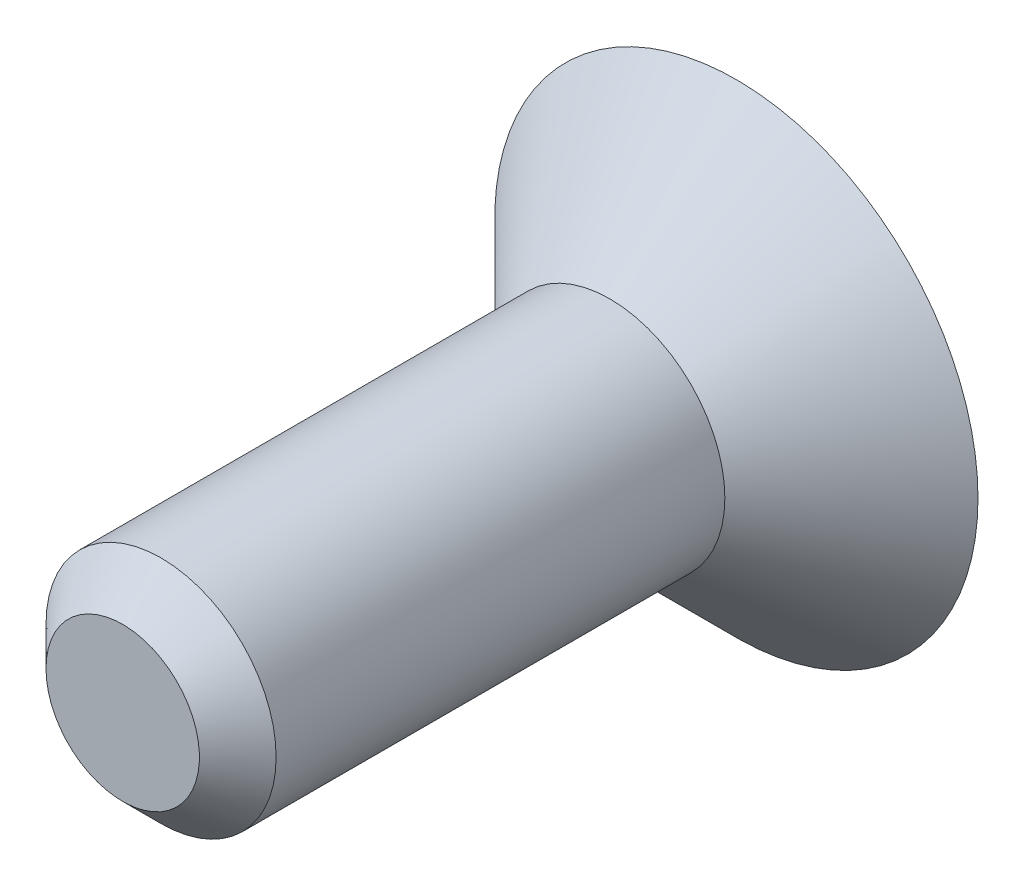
from build123d import *

# Parameters (mm, degrees)
ESQUISSE1_R                  = 3.15
T_TE_DEPTH                   = 2
T_TE_TAPER                   = 45
ESQUISSE2_R                  = 1.5
CORPS_DEPTH                  = 8
ESQUISSE3_W                  = 3.15
ESQUISSE3_H                  = 0.8
EMPREINTE_DEPTH              = 0.8
R_P_TITION_CIRCULAIRE1_COUNT = 2
R_P_TITION_CIRCULAIRE1_ANGLE = 90
CHANFREIN_SIZE               = 0.5


with BuildPart() as part:
    # Esquisse1 → T_te (new body)
    with BuildSketch(Plane.XY):
        Circle(ESQUISSE1_R)
    extrude(amount=T_TE_DEPTH, taper=T_TE_TAPER)

    # Esquisse2 → Corps (add)
    with BuildSketch(Plane(origin=(0, 0, 0), x_dir=(-1, 0, 0), z_dir=(0, 0, -1))):
        Circle(ESQUISSE2_R)
    extrude(amount=-CORPS_DEPTH)

    # Esquisse3 → Empreinte (cut)
    with BuildSketch(Plane.XY):
        Rectangle(ESQUISSE3_W, ESQUISSE3_H)
    empreinte = extrude(amount=EMPREINTE_DEPTH, mode=Mode.SUBTRACT)

    # R_p_tition circulaire1: Empreinte ×2 about axis
    r_p_tition_circulaire1_axis = Axis((0, 0, 0), (0, 0, 1))
    for i in range(1, R_P_TITION_CIRCULAIRE1_COUNT):
        add(empreinte.rotate(r_p_tition_circulaire1_axis, i * R_P_TITION_CIRCULAIRE1_ANGLE / (R_P_TITION_CIRCULAIRE1_COUNT - 1)), mode=Mode.SUBTRACT)

    # Chanfrein
    chanfrein_edges = [part.edges().sort_by_distance(p)[0] for p in [
        (1.5, 0, 8),
    ]]
    chamfer(chanfrein_edges, length=CHANFREIN_SIZE)


solid = part.part
